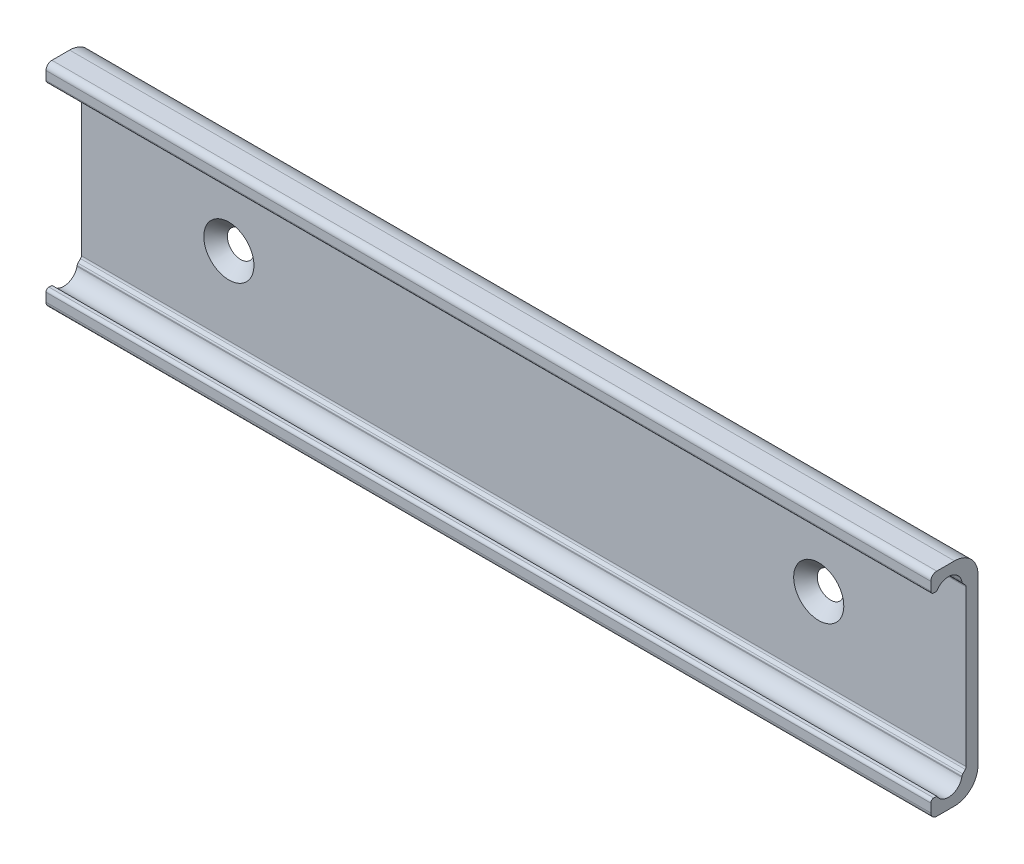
ISO-10303-21;
HEADER;
FILE_DESCRIPTION(('STEP AP214'),'2;1');
FILE_NAME('part.step','',(''),(''),'','','');
FILE_SCHEMA(('AUTOMOTIVE_DESIGN { 1 0 10303 214 1 1 1 1 }'));
ENDSEC;
DATA;
#1=APPLICATION_CONTEXT('core data for automotive mechanical design processes');
#2=APPLICATION_PROTOCOL_DEFINITION('international standard','automotive_design',2000,#1);
#3=PRODUCT_CONTEXT('',#1,'mechanical');
#4=PRODUCT('Part','Part','',(#3));
#5=PRODUCT_RELATED_PRODUCT_CATEGORY('part','',(#4));
#6=PRODUCT_DEFINITION_FORMATION('','',#4);
#7=PRODUCT_DEFINITION_CONTEXT('part definition',#1,'design');
#8=PRODUCT_DEFINITION('design','',#6,#7);
#9=PRODUCT_DEFINITION_SHAPE('','',#8);
#10=(LENGTH_UNIT() NAMED_UNIT(*) SI_UNIT(.MILLI.,.METRE.));
#11=(NAMED_UNIT(*) PLANE_ANGLE_UNIT() SI_UNIT($,.RADIAN.));
#12=(NAMED_UNIT(*) SI_UNIT($,.STERADIAN.) SOLID_ANGLE_UNIT());
#13=UNCERTAINTY_MEASURE_WITH_UNIT(LENGTH_MEASURE(1.E-05),#10,'distance_accuracy_value','');
#14=(GEOMETRIC_REPRESENTATION_CONTEXT(3) GLOBAL_UNCERTAINTY_ASSIGNED_CONTEXT((#13)) GLOBAL_UNIT_ASSIGNED_CONTEXT((#10,
#11,#12)) REPRESENTATION_CONTEXT('',''));
#15=CARTESIAN_POINT('',(0.,0.,0.));
#16=DIRECTION('',(0.,0.,1.));
#17=DIRECTION('',(1.,0.,0.));
#18=AXIS2_PLACEMENT_3D('',#15,#16,#17);
#19=CARTESIAN_POINT('',(125.,14.,4.));
#20=DIRECTION('',(-1.,0.,0.));
#21=DIRECTION('',(0.,0.,1.));
#22=AXIS2_PLACEMENT_3D('',#19,#20,#21);
#23=CYLINDRICAL_SURFACE('',#22,4.);
#24=CARTESIAN_POINT('',(-25.,14.,4.));
#25=DIRECTION('',(-1.,0.,0.));
#26=DIRECTION('',(0.,0.,1.));
#27=AXIS2_PLACEMENT_3D('',#24,#25,#26);
#28=CIRCLE('',#27,4.);
#29=CARTESIAN_POINT('',(-25.,18.,4.));
#30=VERTEX_POINT('',#29);
#31=CARTESIAN_POINT('',(-25.,14.,0.));
#32=VERTEX_POINT('',#31);
#33=EDGE_CURVE('E174',#30,#32,#28,.T.);
#34=ORIENTED_EDGE('',*,*,#33,.F.);
#35=DIRECTION('',(-1.,0.,0.));
#36=VECTOR('',#35,1.);
#37=CARTESIAN_POINT('',(125.,18.,4.));
#38=LINE('',#37,#36);
#39=CARTESIAN_POINT('',(125.,18.,4.));
#40=VERTEX_POINT('',#39);
#41=EDGE_CURVE('E9',#40,#30,#38,.T.);
#42=ORIENTED_EDGE('',*,*,#41,.F.);
#43=CARTESIAN_POINT('',(125.,14.,4.));
#44=DIRECTION('',(-1.,0.,0.));
#45=DIRECTION('',(0.,0.,1.));
#46=AXIS2_PLACEMENT_3D('',#43,#44,#45);
#47=CIRCLE('',#46,4.);
#48=CARTESIAN_POINT('',(125.,14.,0.));
#49=VERTEX_POINT('',#48);
#50=EDGE_CURVE('E176',#40,#49,#47,.T.);
#51=ORIENTED_EDGE('',*,*,#50,.T.);
#52=DIRECTION('',(-1.,0.,0.));
#53=VECTOR('',#52,1.);
#54=CARTESIAN_POINT('',(125.,14.,0.));
#55=LINE('',#54,#53);
#56=EDGE_CURVE('E17',#49,#32,#55,.T.);
#57=ORIENTED_EDGE('',*,*,#56,.T.);
#58=EDGE_LOOP('',(#34,#42,#51,#57));
#59=FACE_BOUND('',#58,.T.);
#60=ADVANCED_FACE('F14',(#59),#23,.T.);
#61=CARTESIAN_POINT('',(125.,18.,7.));
#62=DIRECTION('',(0.,1.,0.));
#63=DIRECTION('',(-1.,0.,0.));
#64=AXIS2_PLACEMENT_3D('',#61,#62,#63);
#65=PLANE('',#64);
#66=DIRECTION('',(0.,0.,-1.));
#67=VECTOR('',#66,1.);
#68=CARTESIAN_POINT('',(-25.,18.,7.));
#69=LINE('',#68,#67);
#70=CARTESIAN_POINT('',(-25.,18.,7.));
#71=VERTEX_POINT('',#70);
#72=EDGE_CURVE('E192',#71,#30,#69,.T.);
#73=ORIENTED_EDGE('',*,*,#72,.F.);
#74=DIRECTION('',(-1.,0.,0.));
#75=VECTOR('',#74,1.);
#76=CARTESIAN_POINT('',(125.,18.,7.));
#77=LINE('',#76,#75);
#78=CARTESIAN_POINT('',(125.,18.,7.));
#79=VERTEX_POINT('',#78);
#80=EDGE_CURVE('E22',#79,#71,#77,.T.);
#81=ORIENTED_EDGE('',*,*,#80,.F.);
#82=DIRECTION('',(0.,0.,-1.));
#83=VECTOR('',#82,1.);
#84=CARTESIAN_POINT('',(125.,18.,7.));
#85=LINE('',#84,#83);
#86=EDGE_CURVE('E181',#79,#40,#85,.T.);
#87=ORIENTED_EDGE('',*,*,#86,.T.);
#88=ORIENTED_EDGE('',*,*,#41,.T.);
#89=EDGE_LOOP('',(#73,#81,#87,#88));
#90=FACE_BOUND('',#89,.T.);
#91=ADVANCED_FACE('F448',(#90),#65,.T.);
#92=CARTESIAN_POINT('',(125.,17.,7.));
#93=DIRECTION('',(-1.,0.,0.));
#94=DIRECTION('',(0.,0.,1.));
#95=AXIS2_PLACEMENT_3D('',#92,#93,#94);
#96=CYLINDRICAL_SURFACE('',#95,1.);
#97=CARTESIAN_POINT('',(-25.,17.,7.));
#98=DIRECTION('',(-1.,0.,0.));
#99=DIRECTION('',(0.,0.,1.));
#100=AXIS2_PLACEMENT_3D('',#97,#98,#99);
#101=CIRCLE('',#100,1.);
#102=CARTESIAN_POINT('',(-25.,17.,8.));
#103=VERTEX_POINT('',#102);
#104=EDGE_CURVE('E258',#103,#71,#101,.T.);
#105=ORIENTED_EDGE('',*,*,#104,.F.);
#106=DIRECTION('',(-1.,0.,0.));
#107=VECTOR('',#106,1.);
#108=CARTESIAN_POINT('',(125.,17.,8.));
#109=LINE('',#108,#107);
#110=CARTESIAN_POINT('',(125.,17.,8.));
#111=VERTEX_POINT('',#110);
#112=EDGE_CURVE('E328',#111,#103,#109,.T.);
#113=ORIENTED_EDGE('',*,*,#112,.F.);
#114=CARTESIAN_POINT('',(125.,17.,7.));
#115=DIRECTION('',(-1.,0.,0.));
#116=DIRECTION('',(0.,0.,1.));
#117=AXIS2_PLACEMENT_3D('',#114,#115,#116);
#118=CIRCLE('',#117,1.);
#119=EDGE_CURVE('E324',#111,#79,#118,.T.);
#120=ORIENTED_EDGE('',*,*,#119,.T.);
#121=ORIENTED_EDGE('',*,*,#80,.T.);
#122=EDGE_LOOP('',(#105,#113,#120,#121));
#123=FACE_BOUND('',#122,.T.);
#124=ADVANCED_FACE('F453',(#123),#96,.T.);
#125=CARTESIAN_POINT('',(125.,15.55,8.));
#126=DIRECTION('',(0.,0.,1.));
#127=DIRECTION('',(1.,0.,0.));
#128=AXIS2_PLACEMENT_3D('',#125,#126,#127);
#129=PLANE('',#128);
#130=DIRECTION('',(0.,1.,0.));
#131=VECTOR('',#130,1.);
#132=CARTESIAN_POINT('',(-25.,15.55,8.));
#133=LINE('',#132,#131);
#134=CARTESIAN_POINT('',(-25.,15.55,8.));
#135=VERTEX_POINT('',#134);
#136=EDGE_CURVE('E255',#135,#103,#133,.T.);
#137=ORIENTED_EDGE('',*,*,#136,.F.);
#138=DIRECTION('',(-1.,0.,0.));
#139=VECTOR('',#138,1.);
#140=CARTESIAN_POINT('',(125.,15.55,8.));
#141=LINE('',#140,#139);
#142=CARTESIAN_POINT('',(125.,15.55,8.));
#143=VERTEX_POINT('',#142);
#144=EDGE_CURVE('E330',#143,#135,#141,.T.);
#145=ORIENTED_EDGE('',*,*,#144,.F.);
#146=DIRECTION('',(0.,1.,0.));
#147=VECTOR('',#146,1.);
#148=CARTESIAN_POINT('',(125.,15.55,8.));
#149=LINE('',#148,#147);
#150=EDGE_CURVE('E321',#143,#111,#149,.T.);
#151=ORIENTED_EDGE('',*,*,#150,.T.);
#152=ORIENTED_EDGE('',*,*,#112,.T.);
#153=EDGE_LOOP('',(#137,#145,#151,#152));
#154=FACE_BOUND('',#153,.T.);
#155=ADVANCED_FACE('F445',(#154),#129,.T.);
#156=CARTESIAN_POINT('',(125.,15.5499998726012,7.5));
#157=DIRECTION('',(-1.,0.,0.));
#158=DIRECTION('',(0.,0.,1.));
#159=AXIS2_PLACEMENT_3D('',#156,#157,#158);
#160=CYLINDRICAL_SURFACE('',#159,0.500000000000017);
#161=CARTESIAN_POINT('',(-25.,15.5499998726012,7.5));
#162=DIRECTION('',(-1.,0.,0.));
#163=DIRECTION('',(0.,0.,1.));
#164=AXIS2_PLACEMENT_3D('',#161,#162,#163);
#165=CIRCLE('',#164,0.500000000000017);
#166=CARTESIAN_POINT('',(-25.,15.0499998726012,7.49999995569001));
#167=VERTEX_POINT('',#166);
#168=EDGE_CURVE('E252',#167,#135,#165,.T.);
#169=ORIENTED_EDGE('',*,*,#168,.F.);
#170=DIRECTION('',(-1.,0.,0.));
#171=VECTOR('',#170,1.);
#172=CARTESIAN_POINT('',(125.,15.0499998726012,7.49999995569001));
#173=LINE('',#172,#171);
#174=CARTESIAN_POINT('',(125.,15.0499998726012,7.49999995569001));
#175=VERTEX_POINT('',#174);
#176=EDGE_CURVE('E332',#175,#167,#173,.T.);
#177=ORIENTED_EDGE('',*,*,#176,.F.);
#178=CARTESIAN_POINT('',(125.,15.5499998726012,7.5));
#179=DIRECTION('',(-1.,0.,0.));
#180=DIRECTION('',(0.,0.,1.));
#181=AXIS2_PLACEMENT_3D('',#178,#179,#180);
#182=CIRCLE('',#181,0.500000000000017);
#183=EDGE_CURVE('E318',#175,#143,#182,.T.);
#184=ORIENTED_EDGE('',*,*,#183,.T.);
#185=ORIENTED_EDGE('',*,*,#144,.T.);
#186=EDGE_LOOP('',(#169,#177,#184,#185));
#187=FACE_BOUND('',#186,.T.);
#188=ADVANCED_FACE('F441',(#187),#160,.T.);
#189=CARTESIAN_POINT('',(125.,15.0499998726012,7.49999995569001));
#190=DIRECTION('',(0.,-1.,0.));
#191=DIRECTION('',(1.,0.,0.));
#192=AXIS2_PLACEMENT_3D('',#189,#190,#191);
#193=PLANE('',#192);
#194=DIRECTION('',(0.,0.,1.));
#195=VECTOR('',#194,1.);
#196=CARTESIAN_POINT('',(-25.,15.0499998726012,7.49999995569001));
#197=LINE('',#196,#195);
#198=CARTESIAN_POINT('',(-25.,15.0499998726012,6.99185845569));
#199=VERTEX_POINT('',#198);
#200=EDGE_CURVE('E249',#199,#167,#197,.T.);
#201=ORIENTED_EDGE('',*,*,#200,.F.);
#202=DIRECTION('',(-1.,0.,0.));
#203=VECTOR('',#202,1.);
#204=CARTESIAN_POINT('',(125.,15.0499998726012,6.99185845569));
#205=LINE('',#204,#203);
#206=CARTESIAN_POINT('',(125.,15.0499998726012,6.99185845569));
#207=VERTEX_POINT('',#206);
#208=EDGE_CURVE('E334',#207,#199,#205,.T.);
#209=ORIENTED_EDGE('',*,*,#208,.F.);
#210=DIRECTION('',(0.,0.,1.));
#211=VECTOR('',#210,1.);
#212=CARTESIAN_POINT('',(125.,15.0499998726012,7.49999995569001));
#213=LINE('',#212,#211);
#214=EDGE_CURVE('E315',#207,#175,#213,.T.);
#215=ORIENTED_EDGE('',*,*,#214,.T.);
#216=ORIENTED_EDGE('',*,*,#176,.T.);
#217=EDGE_LOOP('',(#201,#209,#215,#216));
#218=FACE_BOUND('',#217,.T.);
#219=ADVANCED_FACE('F437',(#218),#193,.T.);
#220=CARTESIAN_POINT('',(125.,13.899999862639,4.99999993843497));
#221=DIRECTION('',(-1.,0.,0.));
#222=DIRECTION('',(0.,0.,1.));
#223=AXIS2_PLACEMENT_3D('',#220,#221,#222);
#224=CYLINDRICAL_SURFACE('',#223,2.30000008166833);
#225=CARTESIAN_POINT('',(-25.,13.899999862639,4.99999993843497));
#226=DIRECTION('',(1.,0.,0.));
#227=DIRECTION('',(0.,0.,1.));
#228=AXIS2_PLACEMENT_3D('',#225,#226,#227);
#229=CIRCLE('',#228,2.30000008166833);
#230=CARTESIAN_POINT('',(-25.,14.3822673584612,2.75112945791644));
#231=VERTEX_POINT('',#230);
#232=EDGE_CURVE('E246',#231,#199,#229,.T.);
#233=ORIENTED_EDGE('',*,*,#232,.F.);
#234=DIRECTION('',(-1.,0.,0.));
#235=VECTOR('',#234,1.);
#236=CARTESIAN_POINT('',(125.,14.3822673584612,2.75112945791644));
#237=LINE('',#236,#235);
#238=CARTESIAN_POINT('',(125.,14.3822673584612,2.75112945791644));
#239=VERTEX_POINT('',#238);
#240=EDGE_CURVE('E336',#239,#231,#237,.T.);
#241=ORIENTED_EDGE('',*,*,#240,.F.);
#242=CARTESIAN_POINT('',(125.,13.899999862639,4.99999993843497));
#243=DIRECTION('',(1.,0.,0.));
#244=DIRECTION('',(0.,0.,1.));
#245=AXIS2_PLACEMENT_3D('',#242,#243,#244);
#246=CIRCLE('',#245,2.30000008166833);
#247=EDGE_CURVE('E312',#239,#207,#246,.T.);
#248=ORIENTED_EDGE('',*,*,#247,.T.);
#249=ORIENTED_EDGE('',*,*,#208,.T.);
#250=EDGE_LOOP('',(#233,#241,#248,#249));
#251=FACE_BOUND('',#250,.T.);
#252=ADVANCED_FACE('F433',(#251),#224,.F.);
#253=CARTESIAN_POINT('',(125.,14.2647621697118,2.72240648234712));
#254=DIRECTION('',(0.,-0.237449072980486,0.971399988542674));
#255=DIRECTION('',(0.,0.971399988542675,0.237449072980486));
#256=AXIS2_PLACEMENT_3D('',#253,#254,#255);
#257=PLANE('',#256);
#258=DIRECTION('',(0.,0.971399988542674,0.237449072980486));
#259=VECTOR('',#258,1.);
#260=CARTESIAN_POINT('',(-25.,14.2647621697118,2.72240648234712));
#261=LINE('',#260,#259);
#262=CARTESIAN_POINT('',(-25.,14.2647621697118,2.72240648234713));
#263=VERTEX_POINT('',#262);
#264=EDGE_CURVE('E243',#263,#231,#261,.T.);
#265=ORIENTED_EDGE('',*,*,#264,.F.);
#266=DIRECTION('',(-1.,0.,0.));
#267=VECTOR('',#266,1.);
#268=CARTESIAN_POINT('',(125.,14.2647621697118,2.72240648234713));
#269=LINE('',#268,#267);
#270=CARTESIAN_POINT('',(125.,14.2647621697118,2.72240648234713));
#271=VERTEX_POINT('',#270);
#272=EDGE_CURVE('E338',#271,#263,#269,.T.);
#273=ORIENTED_EDGE('',*,*,#272,.F.);
#274=DIRECTION('',(0.,0.971399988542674,0.237449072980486));
#275=VECTOR('',#274,1.);
#276=CARTESIAN_POINT('',(125.,14.2647621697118,2.72240648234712));
#277=LINE('',#276,#275);
#278=EDGE_CURVE('E309',#271,#239,#277,.T.);
#279=ORIENTED_EDGE('',*,*,#278,.T.);
#280=ORIENTED_EDGE('',*,*,#240,.T.);
#281=EDGE_LOOP('',(#265,#273,#279,#280));
#282=FACE_BOUND('',#281,.T.);
#283=ADVANCED_FACE('F429',(#282),#257,.T.);
#284=CARTESIAN_POINT('',(125.,14.3343843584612,2.2272774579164));
#285=DIRECTION('',(-1.,0.,0.));
#286=DIRECTION('',(0.,0.,1.));
#287=AXIS2_PLACEMENT_3D('',#284,#285,#286);
#288=CYLINDRICAL_SURFACE('',#287,0.49999999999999);
#289=CARTESIAN_POINT('',(-25.,14.3343843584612,2.2272774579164));
#290=DIRECTION('',(-1.,0.,0.));
#291=DIRECTION('',(0.,0.,1.));
#292=AXIS2_PLACEMENT_3D('',#289,#290,#291);
#293=CIRCLE('',#292,0.49999999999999);
#294=CARTESIAN_POINT('',(-25.,13.980830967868,2.58083084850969));
#295=VERTEX_POINT('',#294);
#296=EDGE_CURVE('E240',#295,#263,#293,.T.);
#297=ORIENTED_EDGE('',*,*,#296,.F.);
#298=DIRECTION('',(-1.,0.,0.));
#299=VECTOR('',#298,1.);
#300=CARTESIAN_POINT('',(125.,13.980830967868,2.58083084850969));
#301=LINE('',#300,#299);
#302=CARTESIAN_POINT('',(125.,13.980830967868,2.58083084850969));
#303=VERTEX_POINT('',#302);
#304=EDGE_CURVE('E340',#303,#295,#301,.T.);
#305=ORIENTED_EDGE('',*,*,#304,.F.);
#306=CARTESIAN_POINT('',(125.,14.3343843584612,2.2272774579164));
#307=DIRECTION('',(-1.,0.,0.));
#308=DIRECTION('',(0.,0.,1.));
#309=AXIS2_PLACEMENT_3D('',#306,#307,#308);
#310=CIRCLE('',#309,0.49999999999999);
#311=EDGE_CURVE('E306',#303,#271,#310,.T.);
#312=ORIENTED_EDGE('',*,*,#311,.T.);
#313=ORIENTED_EDGE('',*,*,#272,.T.);
#314=EDGE_LOOP('',(#297,#305,#312,#313));
#315=FACE_BOUND('',#314,.T.);
#316=ADVANCED_FACE('F425',(#315),#288,.T.);
#317=CARTESIAN_POINT('',(125.,13.5464468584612,2.1464464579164));
#318=DIRECTION('',(0.,-0.707107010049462,0.707106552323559));
#319=DIRECTION('',(0.,0.707106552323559,0.707107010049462));
#320=AXIS2_PLACEMENT_3D('',#317,#318,#319);
#321=PLANE('',#320);
#322=DIRECTION('',(0.,0.707106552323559,0.707107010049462));
#323=VECTOR('',#322,1.);
#324=CARTESIAN_POINT('',(-25.,13.5464468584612,2.1464464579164));
#325=LINE('',#324,#323);
#326=CARTESIAN_POINT('',(-25.,13.5464468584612,2.1464464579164));
#327=VERTEX_POINT('',#326);
#328=EDGE_CURVE('E237',#327,#295,#325,.T.);
#329=ORIENTED_EDGE('',*,*,#328,.F.);
#330=DIRECTION('',(-1.,0.,0.));
#331=VECTOR('',#330,1.);
#332=CARTESIAN_POINT('',(125.,13.5464468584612,2.1464464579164));
#333=LINE('',#332,#331);
#334=CARTESIAN_POINT('',(125.,13.5464468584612,2.1464464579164));
#335=VERTEX_POINT('',#334);
#336=EDGE_CURVE('E342',#335,#327,#333,.T.);
#337=ORIENTED_EDGE('',*,*,#336,.F.);
#338=DIRECTION('',(0.,0.707106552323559,0.707107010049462));
#339=VECTOR('',#338,1.);
#340=CARTESIAN_POINT('',(125.,13.5464468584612,2.1464464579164));
#341=LINE('',#340,#339);
#342=EDGE_CURVE('E303',#335,#303,#341,.T.);
#343=ORIENTED_EDGE('',*,*,#342,.T.);
#344=ORIENTED_EDGE('',*,*,#304,.T.);
#345=EDGE_LOOP('',(#329,#337,#343,#344));
#346=FACE_BOUND('',#345,.T.);
#347=ADVANCED_FACE('F421',(#346),#321,.T.);
#348=CARTESIAN_POINT('',(125.,13.1928934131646,2.49999990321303));
#349=DIRECTION('',(-1.,0.,0.));
#350=DIRECTION('',(0.,0.,1.));
#351=AXIS2_PLACEMENT_3D('',#348,#349,#350);
#352=CYLINDRICAL_SURFACE('',#351,0.500000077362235);
#353=CARTESIAN_POINT('',(-25.,13.1928934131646,2.49999990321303));
#354=DIRECTION('',(1.,0.,0.));
#355=DIRECTION('',(0.,0.,1.));
#356=AXIS2_PLACEMENT_3D('',#353,#354,#355);
#357=CIRCLE('',#356,0.500000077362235);
#358=CARTESIAN_POINT('',(-25.,13.1928934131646,1.9999998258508));
#359=VERTEX_POINT('',#358);
#360=EDGE_CURVE('E234',#359,#327,#357,.T.);
#361=ORIENTED_EDGE('',*,*,#360,.F.);
#362=DIRECTION('',(-1.,0.,0.));
#363=VECTOR('',#362,1.);
#364=CARTESIAN_POINT('',(125.,13.1928934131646,1.9999998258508));
#365=LINE('',#364,#363);
#366=CARTESIAN_POINT('',(125.,13.1928934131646,1.9999998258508));
#367=VERTEX_POINT('',#366);
#368=EDGE_CURVE('E344',#367,#359,#365,.T.);
#369=ORIENTED_EDGE('',*,*,#368,.F.);
#370=CARTESIAN_POINT('',(125.,13.1928934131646,2.49999990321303));
#371=DIRECTION('',(1.,0.,0.));
#372=DIRECTION('',(0.,0.,1.));
#373=AXIS2_PLACEMENT_3D('',#370,#371,#372);
#374=CIRCLE('',#373,0.500000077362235);
#375=EDGE_CURVE('E300',#367,#335,#374,.T.);
#376=ORIENTED_EDGE('',*,*,#375,.T.);
#377=ORIENTED_EDGE('',*,*,#336,.T.);
#378=EDGE_LOOP('',(#361,#369,#376,#377));
#379=FACE_BOUND('',#378,.T.);
#380=ADVANCED_FACE('F417',(#379),#352,.F.);
#381=CARTESIAN_POINT('',(125.,-13.1928934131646,1.9999998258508));
#382=DIRECTION('',(0.,0.,1.));
#383=DIRECTION('',(0.,1.,0.));
#384=AXIS2_PLACEMENT_3D('',#381,#382,#383);
#385=PLANE('',#384);
#386=CARTESIAN_POINT('',(100.,0.,1.9999998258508));
#387=DIRECTION('',(0.,0.,1.));
#388=DIRECTION('',(0.,1.,0.));
#389=AXIS2_PLACEMENT_3D('',#386,#387,#388);
#390=CIRCLE('',#389,4.25);
#391=CARTESIAN_POINT('',(100.,4.25,1.99999982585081));
#392=VERTEX_POINT('',#391);
#393=EDGE_CURVE('E692',#392,#392,#390,.T.);
#394=ORIENTED_EDGE('',*,*,#393,.F.);
#395=EDGE_LOOP('',(#394));
#396=FACE_BOUND('',#395,.T.);
#397=CARTESIAN_POINT('',(0.,0.,1.9999998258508));
#398=DIRECTION('',(0.,0.,1.));
#399=DIRECTION('',(0.,1.,0.));
#400=AXIS2_PLACEMENT_3D('',#397,#398,#399);
#401=CIRCLE('',#400,4.25);
#402=CARTESIAN_POINT('',(0.,4.25,1.99999982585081));
#403=VERTEX_POINT('',#402);
#404=EDGE_CURVE('E196',#403,#403,#401,.T.);
#405=ORIENTED_EDGE('',*,*,#404,.F.);
#406=EDGE_LOOP('',(#405));
#407=FACE_BOUND('',#406,.T.);
#408=DIRECTION('',(0.,1.,0.));
#409=VECTOR('',#408,1.);
#410=CARTESIAN_POINT('',(-25.,-13.1928934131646,1.9999998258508));
#411=LINE('',#410,#409);
#412=CARTESIAN_POINT('',(-25.,-13.1928934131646,1.9999998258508));
#413=VERTEX_POINT('',#412);
#414=EDGE_CURVE('E231',#413,#359,#411,.T.);
#415=ORIENTED_EDGE('',*,*,#414,.F.);
#416=DIRECTION('',(-1.,0.,0.));
#417=VECTOR('',#416,1.);
#418=CARTESIAN_POINT('',(125.,-13.1928934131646,1.9999998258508));
#419=LINE('',#418,#417);
#420=CARTESIAN_POINT('',(125.,-13.1928934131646,1.9999998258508));
#421=VERTEX_POINT('',#420);
#422=EDGE_CURVE('E346',#421,#413,#419,.T.);
#423=ORIENTED_EDGE('',*,*,#422,.F.);
#424=DIRECTION('',(0.,1.,0.));
#425=VECTOR('',#424,1.);
#426=CARTESIAN_POINT('',(125.,-13.1928934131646,1.9999998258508));
#427=LINE('',#426,#425);
#428=EDGE_CURVE('E297',#421,#367,#427,.T.);
#429=ORIENTED_EDGE('',*,*,#428,.T.);
#430=ORIENTED_EDGE('',*,*,#368,.T.);
#431=EDGE_LOOP('',(#415,#423,#429,#430));
#432=FACE_BOUND('',#431,.T.);
#433=ADVANCED_FACE('F413',(#396,#407,#432),#385,.T.);
#434=CARTESIAN_POINT('',(125.,-13.1928934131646,2.49999990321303));
#435=DIRECTION('',(-1.,0.,0.));
#436=DIRECTION('',(0.,0.,1.));
#437=AXIS2_PLACEMENT_3D('',#434,#435,#436);
#438=CYLINDRICAL_SURFACE('',#437,0.500000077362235);
#439=CARTESIAN_POINT('',(-25.,-13.1928934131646,2.49999990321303));
#440=DIRECTION('',(1.,0.,0.));
#441=DIRECTION('',(0.,0.,-1.));
#442=AXIS2_PLACEMENT_3D('',#439,#440,#441);
#443=CIRCLE('',#442,0.500000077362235);
#444=CARTESIAN_POINT('',(-25.,-13.5464468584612,2.1464464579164));
#445=VERTEX_POINT('',#444);
#446=EDGE_CURVE('E228',#445,#413,#443,.T.);
#447=ORIENTED_EDGE('',*,*,#446,.F.);
#448=DIRECTION('',(-1.,0.,0.));
#449=VECTOR('',#448,1.);
#450=CARTESIAN_POINT('',(125.,-13.5464468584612,2.1464464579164));
#451=LINE('',#450,#449);
#452=CARTESIAN_POINT('',(125.,-13.5464468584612,2.1464464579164));
#453=VERTEX_POINT('',#452);
#454=EDGE_CURVE('E348',#453,#445,#451,.T.);
#455=ORIENTED_EDGE('',*,*,#454,.F.);
#456=CARTESIAN_POINT('',(125.,-13.1928934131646,2.49999990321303));
#457=DIRECTION('',(1.,0.,0.));
#458=DIRECTION('',(0.,0.,-1.));
#459=AXIS2_PLACEMENT_3D('',#456,#457,#458);
#460=CIRCLE('',#459,0.500000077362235);
#461=EDGE_CURVE('E294',#453,#421,#460,.T.);
#462=ORIENTED_EDGE('',*,*,#461,.T.);
#463=ORIENTED_EDGE('',*,*,#422,.T.);
#464=EDGE_LOOP('',(#447,#455,#462,#463));
#465=FACE_BOUND('',#464,.T.);
#466=ADVANCED_FACE('F409',(#465),#438,.F.);
#467=CARTESIAN_POINT('',(125.,-13.5464468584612,2.1464464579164));
#468=DIRECTION('',(0.,0.707107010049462,0.707106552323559));
#469=DIRECTION('',(0.,0.707106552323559,-0.707107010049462));
#470=AXIS2_PLACEMENT_3D('',#467,#468,#469);
#471=PLANE('',#470);
#472=DIRECTION('',(0.,0.707106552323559,-0.707107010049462));
#473=VECTOR('',#472,1.);
#474=CARTESIAN_POINT('',(-25.,-13.5464468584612,2.1464464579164));
#475=LINE('',#474,#473);
#476=CARTESIAN_POINT('',(-25.,-13.980830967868,2.58083084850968));
#477=VERTEX_POINT('',#476);
#478=EDGE_CURVE('E225',#477,#445,#475,.T.);
#479=ORIENTED_EDGE('',*,*,#478,.F.);
#480=DIRECTION('',(-1.,0.,0.));
#481=VECTOR('',#480,1.);
#482=CARTESIAN_POINT('',(125.,-13.980830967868,2.58083084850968));
#483=LINE('',#482,#481);
#484=CARTESIAN_POINT('',(125.,-13.980830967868,2.58083084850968));
#485=VERTEX_POINT('',#484);
#486=EDGE_CURVE('E350',#485,#477,#483,.T.);
#487=ORIENTED_EDGE('',*,*,#486,.F.);
#488=DIRECTION('',(0.,0.707106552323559,-0.707107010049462));
#489=VECTOR('',#488,1.);
#490=CARTESIAN_POINT('',(125.,-13.5464468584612,2.1464464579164));
#491=LINE('',#490,#489);
#492=EDGE_CURVE('E291',#485,#453,#491,.T.);
#493=ORIENTED_EDGE('',*,*,#492,.T.);
#494=ORIENTED_EDGE('',*,*,#454,.T.);
#495=EDGE_LOOP('',(#479,#487,#493,#494));
#496=FACE_BOUND('',#495,.T.);
#497=ADVANCED_FACE('F405',(#496),#471,.T.);
#498=CARTESIAN_POINT('',(125.,-14.3343843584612,2.22727745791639));
#499=DIRECTION('',(-1.,0.,0.));
#500=DIRECTION('',(0.,0.,1.));
#501=AXIS2_PLACEMENT_3D('',#498,#499,#500);
#502=CYLINDRICAL_SURFACE('',#501,0.49999999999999);
#503=CARTESIAN_POINT('',(-25.,-14.3343843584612,2.22727745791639));
#504=DIRECTION('',(-1.,0.,0.));
#505=DIRECTION('',(0.,0.,-1.));
#506=AXIS2_PLACEMENT_3D('',#503,#504,#505);
#507=CIRCLE('',#506,0.49999999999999);
#508=CARTESIAN_POINT('',(-25.,-14.2647621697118,2.72240648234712));
#509=VERTEX_POINT('',#508);
#510=EDGE_CURVE('E222',#509,#477,#507,.T.);
#511=ORIENTED_EDGE('',*,*,#510,.F.);
#512=DIRECTION('',(-1.,0.,0.));
#513=VECTOR('',#512,1.);
#514=CARTESIAN_POINT('',(125.,-14.2647621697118,2.72240648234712));
#515=LINE('',#514,#513);
#516=CARTESIAN_POINT('',(125.,-14.2647621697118,2.72240648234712));
#517=VERTEX_POINT('',#516);
#518=EDGE_CURVE('E352',#517,#509,#515,.T.);
#519=ORIENTED_EDGE('',*,*,#518,.F.);
#520=CARTESIAN_POINT('',(125.,-14.3343843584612,2.22727745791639));
#521=DIRECTION('',(-1.,0.,0.));
#522=DIRECTION('',(0.,0.,-1.));
#523=AXIS2_PLACEMENT_3D('',#520,#521,#522);
#524=CIRCLE('',#523,0.49999999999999);
#525=EDGE_CURVE('E288',#517,#485,#524,.T.);
#526=ORIENTED_EDGE('',*,*,#525,.T.);
#527=ORIENTED_EDGE('',*,*,#486,.T.);
#528=EDGE_LOOP('',(#511,#519,#526,#527));
#529=FACE_BOUND('',#528,.T.);
#530=ADVANCED_FACE('F401',(#529),#502,.T.);
#531=CARTESIAN_POINT('',(125.,-14.2647621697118,2.72240648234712));
#532=DIRECTION('',(0.,0.237449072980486,0.971399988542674));
#533=DIRECTION('',(0.,0.971399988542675,-0.237449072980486));
#534=AXIS2_PLACEMENT_3D('',#531,#532,#533);
#535=PLANE('',#534);
#536=DIRECTION('',(0.,0.971399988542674,-0.237449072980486));
#537=VECTOR('',#536,1.);
#538=CARTESIAN_POINT('',(-25.,-14.2647621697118,2.72240648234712));
#539=LINE('',#538,#537);
#540=CARTESIAN_POINT('',(-25.,-14.3822673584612,2.75112945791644));
#541=VERTEX_POINT('',#540);
#542=EDGE_CURVE('E219',#541,#509,#539,.T.);
#543=ORIENTED_EDGE('',*,*,#542,.F.);
#544=DIRECTION('',(-1.,0.,0.));
#545=VECTOR('',#544,1.);
#546=CARTESIAN_POINT('',(125.,-14.3822673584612,2.75112945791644));
#547=LINE('',#546,#545);
#548=CARTESIAN_POINT('',(125.,-14.3822673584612,2.75112945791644));
#549=VERTEX_POINT('',#548);
#550=EDGE_CURVE('E354',#549,#541,#547,.T.);
#551=ORIENTED_EDGE('',*,*,#550,.F.);
#552=DIRECTION('',(0.,0.971399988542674,-0.237449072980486));
#553=VECTOR('',#552,1.);
#554=CARTESIAN_POINT('',(125.,-14.2647621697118,2.72240648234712));
#555=LINE('',#554,#553);
#556=EDGE_CURVE('E285',#549,#517,#555,.T.);
#557=ORIENTED_EDGE('',*,*,#556,.T.);
#558=ORIENTED_EDGE('',*,*,#518,.T.);
#559=EDGE_LOOP('',(#543,#551,#557,#558));
#560=FACE_BOUND('',#559,.T.);
#561=ADVANCED_FACE('F397',(#560),#535,.T.);
#562=CARTESIAN_POINT('',(125.,-13.899999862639,4.99999993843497));
#563=DIRECTION('',(-1.,0.,0.));
#564=DIRECTION('',(0.,0.,1.));
#565=AXIS2_PLACEMENT_3D('',#562,#563,#564);
#566=CYLINDRICAL_SURFACE('',#565,2.30000008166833);
#567=CARTESIAN_POINT('',(-25.,-13.899999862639,4.99999993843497));
#568=DIRECTION('',(1.,0.,0.));
#569=DIRECTION('',(0.,0.,-1.));
#570=AXIS2_PLACEMENT_3D('',#567,#568,#569);
#571=CIRCLE('',#570,2.30000008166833);
#572=CARTESIAN_POINT('',(-25.,-15.0499998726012,6.99185845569));
#573=VERTEX_POINT('',#572);
#574=EDGE_CURVE('E216',#573,#541,#571,.T.);
#575=ORIENTED_EDGE('',*,*,#574,.F.);
#576=DIRECTION('',(-1.,0.,0.));
#577=VECTOR('',#576,1.);
#578=CARTESIAN_POINT('',(125.,-15.0499998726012,6.99185845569));
#579=LINE('',#578,#577);
#580=CARTESIAN_POINT('',(125.,-15.0499998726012,6.99185845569));
#581=VERTEX_POINT('',#580);
#582=EDGE_CURVE('E356',#581,#573,#579,.T.);
#583=ORIENTED_EDGE('',*,*,#582,.F.);
#584=CARTESIAN_POINT('',(125.,-13.899999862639,4.99999993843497));
#585=DIRECTION('',(1.,0.,0.));
#586=DIRECTION('',(0.,0.,-1.));
#587=AXIS2_PLACEMENT_3D('',#584,#585,#586);
#588=CIRCLE('',#587,2.30000008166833);
#589=EDGE_CURVE('E282',#581,#549,#588,.T.);
#590=ORIENTED_EDGE('',*,*,#589,.T.);
#591=ORIENTED_EDGE('',*,*,#550,.T.);
#592=EDGE_LOOP('',(#575,#583,#590,#591));
#593=FACE_BOUND('',#592,.T.);
#594=ADVANCED_FACE('F393',(#593),#566,.F.);
#595=CARTESIAN_POINT('',(125.,-15.0499998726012,7.49999995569));
#596=DIRECTION('',(0.,1.,0.));
#597=DIRECTION('',(-1.,0.,0.));
#598=AXIS2_PLACEMENT_3D('',#595,#596,#597);
#599=PLANE('',#598);
#600=DIRECTION('',(0.,0.,-1.));
#601=VECTOR('',#600,1.);
#602=CARTESIAN_POINT('',(-25.,-15.0499998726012,7.49999995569));
#603=LINE('',#602,#601);
#604=CARTESIAN_POINT('',(-25.,-15.0499998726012,7.49999995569));
#605=VERTEX_POINT('',#604);
#606=EDGE_CURVE('E213',#605,#573,#603,.T.);
#607=ORIENTED_EDGE('',*,*,#606,.F.);
#608=DIRECTION('',(-1.,0.,0.));
#609=VECTOR('',#608,1.);
#610=CARTESIAN_POINT('',(125.,-15.0499998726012,7.49999995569));
#611=LINE('',#610,#609);
#612=CARTESIAN_POINT('',(125.,-15.0499998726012,7.49999995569));
#613=VERTEX_POINT('',#612);
#614=EDGE_CURVE('E358',#613,#605,#611,.T.);
#615=ORIENTED_EDGE('',*,*,#614,.F.);
#616=DIRECTION('',(0.,0.,-1.));
#617=VECTOR('',#616,1.);
#618=CARTESIAN_POINT('',(125.,-15.0499998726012,7.49999995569));
#619=LINE('',#618,#617);
#620=EDGE_CURVE('E279',#613,#581,#619,.T.);
#621=ORIENTED_EDGE('',*,*,#620,.T.);
#622=ORIENTED_EDGE('',*,*,#582,.T.);
#623=EDGE_LOOP('',(#607,#615,#621,#622));
#624=FACE_BOUND('',#623,.T.);
#625=ADVANCED_FACE('F389',(#624),#599,.T.);
#626=CARTESIAN_POINT('',(125.,-15.5499998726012,7.5));
#627=DIRECTION('',(-1.,0.,0.));
#628=DIRECTION('',(0.,0.,1.));
#629=AXIS2_PLACEMENT_3D('',#626,#627,#628);
#630=CYLINDRICAL_SURFACE('',#629,0.500000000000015);
#631=CARTESIAN_POINT('',(-25.,-15.5499998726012,7.5));
#632=DIRECTION('',(-1.,0.,0.));
#633=DIRECTION('',(0.,0.,-1.));
#634=AXIS2_PLACEMENT_3D('',#631,#632,#633);
#635=CIRCLE('',#634,0.500000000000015);
#636=CARTESIAN_POINT('',(-25.,-15.55,8.));
#637=VERTEX_POINT('',#636);
#638=EDGE_CURVE('E210',#637,#605,#635,.T.);
#639=ORIENTED_EDGE('',*,*,#638,.F.);
#640=DIRECTION('',(-1.,0.,0.));
#641=VECTOR('',#640,1.);
#642=CARTESIAN_POINT('',(125.,-15.55,8.));
#643=LINE('',#642,#641);
#644=CARTESIAN_POINT('',(125.,-15.55,8.));
#645=VERTEX_POINT('',#644);
#646=EDGE_CURVE('E360',#645,#637,#643,.T.);
#647=ORIENTED_EDGE('',*,*,#646,.F.);
#648=CARTESIAN_POINT('',(125.,-15.5499998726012,7.5));
#649=DIRECTION('',(-1.,0.,0.));
#650=DIRECTION('',(0.,0.,-1.));
#651=AXIS2_PLACEMENT_3D('',#648,#649,#650);
#652=CIRCLE('',#651,0.500000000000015);
#653=EDGE_CURVE('E276',#645,#613,#652,.T.);
#654=ORIENTED_EDGE('',*,*,#653,.T.);
#655=ORIENTED_EDGE('',*,*,#614,.T.);
#656=EDGE_LOOP('',(#639,#647,#654,#655));
#657=FACE_BOUND('',#656,.T.);
#658=ADVANCED_FACE('F385',(#657),#630,.T.);
#659=CARTESIAN_POINT('',(125.,-15.55,8.));
#660=DIRECTION('',(0.,0.,1.));
#661=DIRECTION('',(1.,0.,0.));
#662=AXIS2_PLACEMENT_3D('',#659,#660,#661);
#663=PLANE('',#662);
#664=DIRECTION('',(0.,1.,0.));
#665=VECTOR('',#664,1.);
#666=CARTESIAN_POINT('',(-25.,-15.55,8.));
#667=LINE('',#666,#665);
#668=CARTESIAN_POINT('',(-25.,-17.,8.));
#669=VERTEX_POINT('',#668);
#670=EDGE_CURVE('E207',#669,#637,#667,.T.);
#671=ORIENTED_EDGE('',*,*,#670,.F.);
#672=DIRECTION('',(-1.,0.,0.));
#673=VECTOR('',#672,1.);
#674=CARTESIAN_POINT('',(125.,-17.,8.));
#675=LINE('',#674,#673);
#676=CARTESIAN_POINT('',(125.,-17.,8.));
#677=VERTEX_POINT('',#676);
#678=EDGE_CURVE('E362',#677,#669,#675,.T.);
#679=ORIENTED_EDGE('',*,*,#678,.F.);
#680=DIRECTION('',(0.,1.,0.));
#681=VECTOR('',#680,1.);
#682=CARTESIAN_POINT('',(125.,-15.55,8.));
#683=LINE('',#682,#681);
#684=EDGE_CURVE('E273',#677,#645,#683,.T.);
#685=ORIENTED_EDGE('',*,*,#684,.T.);
#686=ORIENTED_EDGE('',*,*,#646,.T.);
#687=EDGE_LOOP('',(#671,#679,#685,#686));
#688=FACE_BOUND('',#687,.T.);
#689=ADVANCED_FACE('F381',(#688),#663,.T.);
#690=CARTESIAN_POINT('',(125.,-17.,7.));
#691=DIRECTION('',(-1.,0.,0.));
#692=DIRECTION('',(0.,0.,1.));
#693=AXIS2_PLACEMENT_3D('',#690,#691,#692);
#694=CYLINDRICAL_SURFACE('',#693,1.);
#695=CARTESIAN_POINT('',(-25.,-17.,7.));
#696=DIRECTION('',(-1.,0.,0.));
#697=DIRECTION('',(0.,0.,-1.));
#698=AXIS2_PLACEMENT_3D('',#695,#696,#697);
#699=CIRCLE('',#698,1.);
#700=CARTESIAN_POINT('',(-25.,-18.,7.));
#701=VERTEX_POINT('',#700);
#702=EDGE_CURVE('E204',#701,#669,#699,.T.);
#703=ORIENTED_EDGE('',*,*,#702,.F.);
#704=DIRECTION('',(-1.,0.,0.));
#705=VECTOR('',#704,1.);
#706=CARTESIAN_POINT('',(125.,-18.,7.));
#707=LINE('',#706,#705);
#708=CARTESIAN_POINT('',(125.,-18.,7.));
#709=VERTEX_POINT('',#708);
#710=EDGE_CURVE('E364',#709,#701,#707,.T.);
#711=ORIENTED_EDGE('',*,*,#710,.F.);
#712=CARTESIAN_POINT('',(125.,-17.,7.));
#713=DIRECTION('',(-1.,0.,0.));
#714=DIRECTION('',(0.,0.,-1.));
#715=AXIS2_PLACEMENT_3D('',#712,#713,#714);
#716=CIRCLE('',#715,1.);
#717=EDGE_CURVE('E270',#709,#677,#716,.T.);
#718=ORIENTED_EDGE('',*,*,#717,.T.);
#719=ORIENTED_EDGE('',*,*,#678,.T.);
#720=EDGE_LOOP('',(#703,#711,#718,#719));
#721=FACE_BOUND('',#720,.T.);
#722=ADVANCED_FACE('F377',(#721),#694,.T.);
#723=CARTESIAN_POINT('',(125.,-18.,7.));
#724=DIRECTION('',(0.,-1.,0.));
#725=DIRECTION('',(1.,0.,0.));
#726=AXIS2_PLACEMENT_3D('',#723,#724,#725);
#727=PLANE('',#726);
#728=DIRECTION('',(0.,0.,1.));
#729=VECTOR('',#728,1.);
#730=CARTESIAN_POINT('',(-25.,-18.,7.));
#731=LINE('',#730,#729);
#732=CARTESIAN_POINT('',(-25.,-18.,4.));
#733=VERTEX_POINT('',#732);
#734=EDGE_CURVE('E201',#733,#701,#731,.T.);
#735=ORIENTED_EDGE('',*,*,#734,.F.);
#736=DIRECTION('',(-1.,0.,0.));
#737=VECTOR('',#736,1.);
#738=CARTESIAN_POINT('',(125.,-18.,4.));
#739=LINE('',#738,#737);
#740=CARTESIAN_POINT('',(125.,-18.,4.));
#741=VERTEX_POINT('',#740);
#742=EDGE_CURVE('E366',#741,#733,#739,.T.);
#743=ORIENTED_EDGE('',*,*,#742,.F.);
#744=DIRECTION('',(0.,0.,1.));
#745=VECTOR('',#744,1.);
#746=CARTESIAN_POINT('',(125.,-18.,7.));
#747=LINE('',#746,#745);
#748=EDGE_CURVE('E267',#741,#709,#747,.T.);
#749=ORIENTED_EDGE('',*,*,#748,.T.);
#750=ORIENTED_EDGE('',*,*,#710,.T.);
#751=EDGE_LOOP('',(#735,#743,#749,#750));
#752=FACE_BOUND('',#751,.T.);
#753=ADVANCED_FACE('F373',(#752),#727,.T.);
#754=CARTESIAN_POINT('',(125.,-14.,4.));
#755=DIRECTION('',(-1.,0.,0.));
#756=DIRECTION('',(0.,0.,1.));
#757=AXIS2_PLACEMENT_3D('',#754,#755,#756);
#758=CYLINDRICAL_SURFACE('',#757,4.);
#759=CARTESIAN_POINT('',(-25.,-14.,4.));
#760=DIRECTION('',(-1.,0.,0.));
#761=DIRECTION('',(0.,0.,-1.));
#762=AXIS2_PLACEMENT_3D('',#759,#760,#761);
#763=CIRCLE('',#762,4.);
#764=CARTESIAN_POINT('',(-25.,-14.,0.));
#765=VERTEX_POINT('',#764);
#766=EDGE_CURVE('E188',#765,#733,#763,.T.);
#767=ORIENTED_EDGE('',*,*,#766,.F.);
#768=DIRECTION('',(-1.,0.,0.));
#769=VECTOR('',#768,1.);
#770=CARTESIAN_POINT('',(125.,-14.,0.));
#771=LINE('',#770,#769);
#772=CARTESIAN_POINT('',(125.,-14.,0.));
#773=VERTEX_POINT('',#772);
#774=EDGE_CURVE('E180',#773,#765,#771,.T.);
#775=ORIENTED_EDGE('',*,*,#774,.F.);
#776=CARTESIAN_POINT('',(125.,-14.,4.));
#777=DIRECTION('',(-1.,0.,0.));
#778=DIRECTION('',(0.,0.,-1.));
#779=AXIS2_PLACEMENT_3D('',#776,#777,#778);
#780=CIRCLE('',#779,4.);
#781=EDGE_CURVE('E264',#773,#741,#780,.T.);
#782=ORIENTED_EDGE('',*,*,#781,.T.);
#783=ORIENTED_EDGE('',*,*,#742,.T.);
#784=EDGE_LOOP('',(#767,#775,#782,#783));
#785=FACE_BOUND('',#784,.T.);
#786=ADVANCED_FACE('F369',(#785),#758,.T.);
#787=CARTESIAN_POINT('',(125.,-14.,0.));
#788=DIRECTION('',(0.,0.,-1.));
#789=DIRECTION('',(-1.,0.,0.));
#790=AXIS2_PLACEMENT_3D('',#787,#788,#789);
#791=PLANE('',#790);
#792=CARTESIAN_POINT('',(100.,0.,-1.74149182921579E-07));
#793=DIRECTION('',(0.,0.,1.));
#794=DIRECTION('',(0.,1.,0.));
#795=AXIS2_PLACEMENT_3D('',#792,#793,#794);
#796=CIRCLE('',#795,2.25);
#797=CARTESIAN_POINT('',(100.,2.25,-1.74149182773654E-07));
#798=VERTEX_POINT('',#797);
#799=EDGE_CURVE('E695',#798,#798,#796,.T.);
#800=ORIENTED_EDGE('',*,*,#799,.T.);
#801=EDGE_LOOP('',(#800));
#802=FACE_BOUND('',#801,.T.);
#803=CARTESIAN_POINT('',(0.,0.,-1.74149182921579E-07));
#804=DIRECTION('',(0.,0.,1.));
#805=DIRECTION('',(0.,1.,0.));
#806=AXIS2_PLACEMENT_3D('',#803,#804,#805);
#807=CIRCLE('',#806,2.25);
#808=CARTESIAN_POINT('',(0.,2.25,-1.74149182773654E-07));
#809=VERTEX_POINT('',#808);
#810=EDGE_CURVE('E193',#809,#809,#807,.T.);
#811=ORIENTED_EDGE('',*,*,#810,.T.);
#812=EDGE_LOOP('',(#811));
#813=FACE_BOUND('',#812,.T.);
#814=DIRECTION('',(0.,-1.,0.));
#815=VECTOR('',#814,1.);
#816=CARTESIAN_POINT('',(-25.,-14.,0.));
#817=LINE('',#816,#815);
#818=EDGE_CURVE('E183',#32,#765,#817,.T.);
#819=ORIENTED_EDGE('',*,*,#818,.F.);
#820=ORIENTED_EDGE('',*,*,#56,.F.);
#821=DIRECTION('',(0.,-1.,0.));
#822=VECTOR('',#821,1.);
#823=CARTESIAN_POINT('',(125.,-14.,0.));
#824=LINE('',#823,#822);
#825=EDGE_CURVE('E262',#49,#773,#824,.T.);
#826=ORIENTED_EDGE('',*,*,#825,.T.);
#827=ORIENTED_EDGE('',*,*,#774,.T.);
#828=EDGE_LOOP('',(#819,#820,#826,#827));
#829=FACE_BOUND('',#828,.T.);
#830=ADVANCED_FACE('F184',(#802,#813,#829),#791,.T.);
#831=CARTESIAN_POINT('',(125.,14.,4.));
#832=DIRECTION('',(-1.,0.,0.));
#833=DIRECTION('',(0.,0.,1.));
#834=AXIS2_PLACEMENT_3D('',#831,#832,#833);
#835=PLANE('',#834);
#836=ORIENTED_EDGE('',*,*,#50,.F.);
#837=ORIENTED_EDGE('',*,*,#86,.F.);
#838=ORIENTED_EDGE('',*,*,#119,.F.);
#839=ORIENTED_EDGE('',*,*,#150,.F.);
#840=ORIENTED_EDGE('',*,*,#183,.F.);
#841=ORIENTED_EDGE('',*,*,#214,.F.);
#842=ORIENTED_EDGE('',*,*,#247,.F.);
#843=ORIENTED_EDGE('',*,*,#278,.F.);
#844=ORIENTED_EDGE('',*,*,#311,.F.);
#845=ORIENTED_EDGE('',*,*,#342,.F.);
#846=ORIENTED_EDGE('',*,*,#375,.F.);
#847=ORIENTED_EDGE('',*,*,#428,.F.);
#848=ORIENTED_EDGE('',*,*,#461,.F.);
#849=ORIENTED_EDGE('',*,*,#492,.F.);
#850=ORIENTED_EDGE('',*,*,#525,.F.);
#851=ORIENTED_EDGE('',*,*,#556,.F.);
#852=ORIENTED_EDGE('',*,*,#589,.F.);
#853=ORIENTED_EDGE('',*,*,#620,.F.);
#854=ORIENTED_EDGE('',*,*,#653,.F.);
#855=ORIENTED_EDGE('',*,*,#684,.F.);
#856=ORIENTED_EDGE('',*,*,#717,.F.);
#857=ORIENTED_EDGE('',*,*,#748,.F.);
#858=ORIENTED_EDGE('',*,*,#781,.F.);
#859=ORIENTED_EDGE('',*,*,#825,.F.);
#860=EDGE_LOOP('',(#836,#837,#838,#839,#840,#841,#842,#843,#844,#845,#846,#847,#848,#849,#850,
#851,#852,#853,#854,#855,#856,#857,#858,#859));
#861=FACE_BOUND('',#860,.T.);
#862=ADVANCED_FACE('F452',(#861),#835,.F.);
#863=CARTESIAN_POINT('',(-25.,14.,4.));
#864=DIRECTION('',(-1.,0.,0.));
#865=DIRECTION('',(0.,0.,1.));
#866=AXIS2_PLACEMENT_3D('',#863,#864,#865);
#867=PLANE('',#866);
#868=ORIENTED_EDGE('',*,*,#33,.T.);
#869=ORIENTED_EDGE('',*,*,#818,.T.);
#870=ORIENTED_EDGE('',*,*,#766,.T.);
#871=ORIENTED_EDGE('',*,*,#734,.T.);
#872=ORIENTED_EDGE('',*,*,#702,.T.);
#873=ORIENTED_EDGE('',*,*,#670,.T.);
#874=ORIENTED_EDGE('',*,*,#638,.T.);
#875=ORIENTED_EDGE('',*,*,#606,.T.);
#876=ORIENTED_EDGE('',*,*,#574,.T.);
#877=ORIENTED_EDGE('',*,*,#542,.T.);
#878=ORIENTED_EDGE('',*,*,#510,.T.);
#879=ORIENTED_EDGE('',*,*,#478,.T.);
#880=ORIENTED_EDGE('',*,*,#446,.T.);
#881=ORIENTED_EDGE('',*,*,#414,.T.);
#882=ORIENTED_EDGE('',*,*,#360,.T.);
#883=ORIENTED_EDGE('',*,*,#328,.T.);
#884=ORIENTED_EDGE('',*,*,#296,.T.);
#885=ORIENTED_EDGE('',*,*,#264,.T.);
#886=ORIENTED_EDGE('',*,*,#232,.T.);
#887=ORIENTED_EDGE('',*,*,#200,.T.);
#888=ORIENTED_EDGE('',*,*,#168,.T.);
#889=ORIENTED_EDGE('',*,*,#136,.T.);
#890=ORIENTED_EDGE('',*,*,#104,.T.);
#891=ORIENTED_EDGE('',*,*,#72,.T.);
#892=EDGE_LOOP('',(#868,#869,#870,#871,#872,#873,#874,#875,#876,#877,#878,#879,#880,#881,#882,
#883,#884,#885,#886,#887,#888,#889,#890,#891));
#893=FACE_BOUND('',#892,.T.);
#894=ADVANCED_FACE('F190',(#893),#867,.T.);
#895=CARTESIAN_POINT('',(0.,0.,1.9999998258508));
#896=DIRECTION('',(0.,0.,1.));
#897=DIRECTION('',(0.,1.,0.));
#898=AXIS2_PLACEMENT_3D('',#895,#896,#897);
#899=CONICAL_SURFACE('',#898,4.25,0.78539816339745);
#900=ORIENTED_EDGE('',*,*,#404,.T.);
#901=EDGE_LOOP('',(#900));
#902=FACE_BOUND('',#901,.T.);
#903=ORIENTED_EDGE('',*,*,#810,.F.);
#904=EDGE_LOOP('',(#903));
#905=FACE_BOUND('',#904,.T.);
#906=ADVANCED_FACE('F645',(#902,#905),#899,.F.);
#907=CARTESIAN_POINT('',(100.,0.,1.9999998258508));
#908=DIRECTION('',(0.,0.,1.));
#909=DIRECTION('',(0.,1.,0.));
#910=AXIS2_PLACEMENT_3D('',#907,#908,#909);
#911=CONICAL_SURFACE('',#910,4.25,0.78539816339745);
#912=ORIENTED_EDGE('',*,*,#393,.T.);
#913=EDGE_LOOP('',(#912));
#914=FACE_BOUND('',#913,.T.);
#915=ORIENTED_EDGE('',*,*,#799,.F.);
#916=EDGE_LOOP('',(#915));
#917=FACE_BOUND('',#916,.T.);
#918=ADVANCED_FACE('F653',(#914,#917),#911,.F.);
#919=CLOSED_SHELL('',(#60,#91,#124,#155,#188,#219,#252,#283,#316,#347,#380,#433,#466,#497,#530,
#561,#594,#625,#658,#689,#722,#753,#786,#830,#862,#894,#906,#918));
#920=MANIFOLD_SOLID_BREP('B1',#919);
#921=ADVANCED_BREP_SHAPE_REPRESENTATION('',(#18,#920),#14);
#922=SHAPE_DEFINITION_REPRESENTATION(#9,#921);
ENDSEC;
END-ISO-10303-21;
